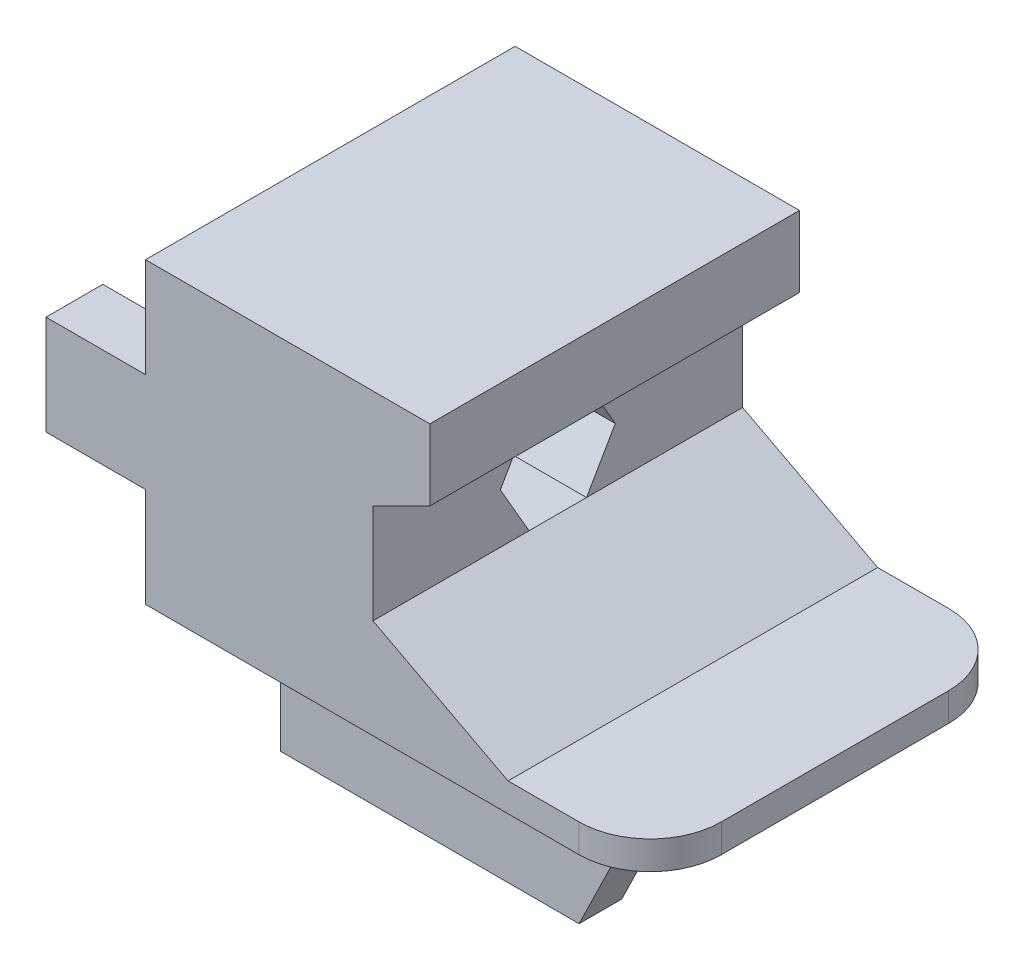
ISO-10303-21;
HEADER;
FILE_DESCRIPTION(('STEP AP214'),'2;1');
FILE_NAME('part.step','',(''),(''),'','','');
FILE_SCHEMA(('AUTOMOTIVE_DESIGN { 1 0 10303 214 1 1 1 1 }'));
ENDSEC;
DATA;
#1=APPLICATION_CONTEXT('core data for automotive mechanical design processes');
#2=APPLICATION_PROTOCOL_DEFINITION('international standard','automotive_design',2000,#1);
#3=PRODUCT_CONTEXT('',#1,'mechanical');
#4=PRODUCT('Part','Part','',(#3));
#5=PRODUCT_RELATED_PRODUCT_CATEGORY('part','',(#4));
#6=PRODUCT_DEFINITION_FORMATION('','',#4);
#7=PRODUCT_DEFINITION_CONTEXT('part definition',#1,'design');
#8=PRODUCT_DEFINITION('design','',#6,#7);
#9=PRODUCT_DEFINITION_SHAPE('','',#8);
#10=(LENGTH_UNIT() NAMED_UNIT(*) SI_UNIT(.MILLI.,.METRE.));
#11=(NAMED_UNIT(*) PLANE_ANGLE_UNIT() SI_UNIT($,.RADIAN.));
#12=(NAMED_UNIT(*) SI_UNIT($,.STERADIAN.) SOLID_ANGLE_UNIT());
#13=UNCERTAINTY_MEASURE_WITH_UNIT(LENGTH_MEASURE(1.E-05),#10,'distance_accuracy_value','');
#14=(GEOMETRIC_REPRESENTATION_CONTEXT(3) GLOBAL_UNCERTAINTY_ASSIGNED_CONTEXT((#13)) GLOBAL_UNIT_ASSIGNED_CONTEXT((#10,
#11,#12)) REPRESENTATION_CONTEXT('',''));
#15=CARTESIAN_POINT('',(0.,0.,0.));
#16=DIRECTION('',(0.,0.,1.));
#17=DIRECTION('',(1.,0.,0.));
#18=AXIS2_PLACEMENT_3D('',#15,#16,#17);
#19=CARTESIAN_POINT('',(16.,14.,26.));
#20=DIRECTION('',(-1.,0.,0.));
#21=DIRECTION('',(0.,0.,1.));
#22=AXIS2_PLACEMENT_3D('',#19,#20,#21);
#23=PLANE('',#22);
#24=DIRECTION('',(0.,0.,-1.));
#25=VECTOR('',#24,1.);
#26=CARTESIAN_POINT('',(16.,7.,26.));
#27=LINE('',#26,#25);
#28=CARTESIAN_POINT('',(16.,7.,26.));
#29=VERTEX_POINT('',#28);
#30=CARTESIAN_POINT('',(16.,7.,15.0207259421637));
#31=VERTEX_POINT('',#30);
#32=EDGE_CURVE('E477',#29,#31,#27,.T.);
#33=ORIENTED_EDGE('',*,*,#32,.T.);
#34=DIRECTION('',(0.,-0.866025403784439,-0.5));
#35=VECTOR('',#34,1.);
#36=CARTESIAN_POINT('',(16.,10.5,17.0414518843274));
#37=LINE('',#36,#35);
#38=CARTESIAN_POINT('',(16.,10.5,17.0414518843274));
#39=VERTEX_POINT('',#38);
#40=EDGE_CURVE('E280',#39,#31,#37,.T.);
#41=ORIENTED_EDGE('',*,*,#40,.F.);
#42=DIRECTION('',(0.,-0.866025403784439,0.5));
#43=VECTOR('',#42,1.);
#44=CARTESIAN_POINT('',(16.,14.,15.0207259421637));
#45=LINE('',#44,#43);
#46=CARTESIAN_POINT('',(16.,14.,15.0207259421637));
#47=VERTEX_POINT('',#46);
#48=EDGE_CURVE('E296',#47,#39,#45,.T.);
#49=ORIENTED_EDGE('',*,*,#48,.F.);
#50=DIRECTION('',(0.,0.,-1.));
#51=VECTOR('',#50,1.);
#52=CARTESIAN_POINT('',(16.,14.,26.));
#53=LINE('',#52,#51);
#54=CARTESIAN_POINT('',(16.,14.,26.));
#55=VERTEX_POINT('',#54);
#56=EDGE_CURVE('E473',#55,#47,#53,.T.);
#57=ORIENTED_EDGE('',*,*,#56,.F.);
#58=DIRECTION('',(0.,1.,0.));
#59=VECTOR('',#58,1.);
#60=CARTESIAN_POINT('',(16.,14.,26.));
#61=LINE('',#60,#59);
#62=EDGE_CURVE('E437',#29,#55,#61,.T.);
#63=ORIENTED_EDGE('',*,*,#62,.F.);
#64=EDGE_LOOP('',(#33,#41,#49,#57,#63));
#65=FACE_BOUND('',#64,.T.);
#66=ADVANCED_FACE('F32',(#65),#23,.F.);
#67=CARTESIAN_POINT('',(-7.,10.5,13.));
#68=DIRECTION('',(1.,0.,0.));
#69=DIRECTION('',(0.,0.,-1.));
#70=AXIS2_PLACEMENT_3D('',#67,#68,#69);
#71=CYLINDRICAL_SURFACE('',#70,2.);
#72=CARTESIAN_POINT('',(-2.,10.5,13.));
#73=DIRECTION('',(-1.,0.,0.));
#74=DIRECTION('',(0.,0.,1.));
#75=AXIS2_PLACEMENT_3D('',#72,#73,#74);
#76=CIRCLE('',#75,2.);
#77=CARTESIAN_POINT('',(-2.,10.5,15.));
#78=VERTEX_POINT('',#77);
#79=EDGE_CURVE('E315',#78,#78,#76,.T.);
#80=ORIENTED_EDGE('',*,*,#79,.T.);
#81=EDGE_LOOP('',(#80));
#82=FACE_BOUND('',#81,.T.);
#83=CARTESIAN_POINT('',(9.,10.5,13.));
#84=DIRECTION('',(1.,0.,0.));
#85=DIRECTION('',(0.,0.,-1.));
#86=AXIS2_PLACEMENT_3D('',#83,#84,#85);
#87=CIRCLE('',#86,2.);
#88=CARTESIAN_POINT('',(9.,10.5,11.));
#89=VERTEX_POINT('',#88);
#90=EDGE_CURVE('E303',#89,#89,#87,.F.);
#91=ORIENTED_EDGE('',*,*,#90,.F.);
#92=EDGE_LOOP('',(#91));
#93=FACE_BOUND('',#92,.T.);
#94=ADVANCED_FACE('F547',(#82,#93),#71,.F.);
#95=CARTESIAN_POINT('',(-7.,0.,0.));
#96=DIRECTION('',(-1.,0.,0.));
#97=DIRECTION('',(0.,0.,1.));
#98=AXIS2_PLACEMENT_3D('',#95,#96,#97);
#99=PLANE('',#98);
#100=DIRECTION('',(0.,-1.,0.));
#101=VECTOR('',#100,1.);
#102=CARTESIAN_POINT('',(-7.,0.,4.));
#103=LINE('',#102,#101);
#104=CARTESIAN_POINT('',(-7.,14.,4.));
#105=VERTEX_POINT('',#104);
#106=CARTESIAN_POINT('',(-7.,7.,4.));
#107=VERTEX_POINT('',#106);
#108=EDGE_CURVE('E496',#105,#107,#103,.T.);
#109=ORIENTED_EDGE('',*,*,#108,.F.);
#110=DIRECTION('',(0.,0.,-1.));
#111=VECTOR('',#110,1.);
#112=CARTESIAN_POINT('',(-7.,14.,0.));
#113=LINE('',#112,#111);
#114=CARTESIAN_POINT('',(-7.,14.,0.));
#115=VERTEX_POINT('',#114);
#116=EDGE_CURVE('E336',#105,#115,#113,.T.);
#117=ORIENTED_EDGE('',*,*,#116,.T.);
#118=DIRECTION('',(0.,-1.,0.));
#119=VECTOR('',#118,1.);
#120=CARTESIAN_POINT('',(-7.,14.,0.));
#121=LINE('',#120,#119);
#122=CARTESIAN_POINT('',(-7.,7.,0.));
#123=VERTEX_POINT('',#122);
#124=EDGE_CURVE('E341',#115,#123,#121,.T.);
#125=ORIENTED_EDGE('',*,*,#124,.T.);
#126=DIRECTION('',(0.,0.,1.));
#127=VECTOR('',#126,1.);
#128=CARTESIAN_POINT('',(-7.,7.,0.));
#129=LINE('',#128,#127);
#130=EDGE_CURVE('E344',#123,#107,#129,.T.);
#131=ORIENTED_EDGE('',*,*,#130,.T.);
#132=EDGE_LOOP('',(#109,#117,#125,#131));
#133=FACE_BOUND('',#132,.T.);
#134=ADVANCED_FACE('F554',(#133),#99,.T.);
#135=CARTESIAN_POINT('',(0.,0.,26.));
#136=DIRECTION('',(1.,0.,0.));
#137=DIRECTION('',(0.,0.,-1.));
#138=AXIS2_PLACEMENT_3D('',#135,#136,#137);
#139=PLANE('',#138);
#140=DIRECTION('',(0.,0.,1.));
#141=VECTOR('',#140,1.);
#142=CARTESIAN_POINT('',(0.,7.,0.));
#143=LINE('',#142,#141);
#144=CARTESIAN_POINT('',(0.,7.,0.));
#145=VERTEX_POINT('',#144);
#146=CARTESIAN_POINT('',(0.,7.,26.));
#147=VERTEX_POINT('',#146);
#148=EDGE_CURVE('E337',#145,#147,#143,.T.);
#149=ORIENTED_EDGE('',*,*,#148,.F.);
#150=DIRECTION('',(0.,-1.,0.));
#151=VECTOR('',#150,1.);
#152=CARTESIAN_POINT('',(0.,0.,0.));
#153=LINE('',#152,#151);
#154=CARTESIAN_POINT('',(0.,0.,0.));
#155=VERTEX_POINT('',#154);
#156=EDGE_CURVE('E426',#145,#155,#153,.T.);
#157=ORIENTED_EDGE('',*,*,#156,.T.);
#158=DIRECTION('',(0.,0.,-1.));
#159=VECTOR('',#158,1.);
#160=CARTESIAN_POINT('',(0.,0.,26.));
#161=LINE('',#160,#159);
#162=CARTESIAN_POINT('',(0.,0.,26.));
#163=VERTEX_POINT('',#162);
#164=EDGE_CURVE('E489',#163,#155,#161,.T.);
#165=ORIENTED_EDGE('',*,*,#164,.F.);
#166=DIRECTION('',(0.,-1.,0.));
#167=VECTOR('',#166,1.);
#168=CARTESIAN_POINT('',(0.,0.,26.));
#169=LINE('',#168,#167);
#170=EDGE_CURVE('E431',#147,#163,#169,.T.);
#171=ORIENTED_EDGE('',*,*,#170,.F.);
#172=EDGE_LOOP('',(#149,#157,#165,#171));
#173=FACE_BOUND('',#172,.T.);
#174=ADVANCED_FACE('F616',(#173),#139,.F.);
#175=DIRECTION('',(0.,0.,-1.));
#176=VECTOR('',#175,1.);
#177=CARTESIAN_POINT('',(0.,14.,0.));
#178=LINE('',#177,#176);
#179=CARTESIAN_POINT('',(0.,14.,26.));
#180=VERTEX_POINT('',#179);
#181=CARTESIAN_POINT('',(0.,14.,0.));
#182=VERTEX_POINT('',#181);
#183=EDGE_CURVE('E332',#180,#182,#178,.T.);
#184=ORIENTED_EDGE('',*,*,#183,.F.);
#185=CARTESIAN_POINT('',(0.,21.,26.));
#186=VERTEX_POINT('',#185);
#187=EDGE_CURVE('E427',#186,#180,#169,.T.);
#188=ORIENTED_EDGE('',*,*,#187,.F.);
#189=DIRECTION('',(0.,0.,-1.));
#190=VECTOR('',#189,1.);
#191=CARTESIAN_POINT('',(0.,21.,26.));
#192=LINE('',#191,#190);
#193=CARTESIAN_POINT('',(0.,21.,0.));
#194=VERTEX_POINT('',#193);
#195=EDGE_CURVE('E445',#186,#194,#192,.T.);
#196=ORIENTED_EDGE('',*,*,#195,.T.);
#197=EDGE_CURVE('E446',#194,#182,#153,.T.);
#198=ORIENTED_EDGE('',*,*,#197,.T.);
#199=EDGE_LOOP('',(#184,#188,#196,#198));
#200=FACE_BOUND('',#199,.T.);
#201=ADVANCED_FACE('F622',(#200),#139,.F.);
#202=CARTESIAN_POINT('',(0.,0.,26.));
#203=DIRECTION('',(0.,1.,0.));
#204=DIRECTION('',(0.,0.,1.));
#205=AXIS2_PLACEMENT_3D('',#202,#203,#204);
#206=PLANE('',#205);
#207=DIRECTION('',(0.,0.,1.));
#208=VECTOR('',#207,1.);
#209=CARTESIAN_POINT('',(30.5,0.,22.));
#210=LINE('',#209,#208);
#211=CARTESIAN_POINT('',(30.5,0.,19.));
#212=VERTEX_POINT('',#211);
#213=CARTESIAN_POINT('',(30.5,0.,22.));
#214=VERTEX_POINT('',#213);
#215=EDGE_CURVE('E417',#212,#214,#210,.T.);
#216=ORIENTED_EDGE('',*,*,#215,.F.);
#217=DIRECTION('',(1.,0.,0.));
#218=VECTOR('',#217,1.);
#219=CARTESIAN_POINT('',(5.49999999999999,0.,19.));
#220=LINE('',#219,#218);
#221=CARTESIAN_POINT('',(5.49999999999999,0.,19.));
#222=VERTEX_POINT('',#221);
#223=EDGE_CURVE('E414',#222,#212,#220,.T.);
#224=ORIENTED_EDGE('',*,*,#223,.F.);
#225=DIRECTION('',(0.,0.,-1.));
#226=VECTOR('',#225,1.);
#227=CARTESIAN_POINT('',(5.49999999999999,0.,22.));
#228=LINE('',#227,#226);
#229=CARTESIAN_POINT('',(5.49999999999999,0.,22.));
#230=VERTEX_POINT('',#229);
#231=EDGE_CURVE('E401',#230,#222,#228,.T.);
#232=ORIENTED_EDGE('',*,*,#231,.F.);
#233=DIRECTION('',(-1.,0.,0.));
#234=VECTOR('',#233,1.);
#235=CARTESIAN_POINT('',(5.49999999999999,0.,22.));
#236=LINE('',#235,#234);
#237=EDGE_CURVE('E406',#214,#230,#236,.T.);
#238=ORIENTED_EDGE('',*,*,#237,.F.);
#239=EDGE_LOOP('',(#216,#224,#232,#238));
#240=FACE_BOUND('',#239,.T.);
#241=DIRECTION('',(1.,0.,0.));
#242=VECTOR('',#241,1.);
#243=CARTESIAN_POINT('',(0.,0.,0.));
#244=LINE('',#243,#242);
#245=CARTESIAN_POINT('',(30.5,0.,0.));
#246=VERTEX_POINT('',#245);
#247=EDGE_CURVE('E448',#155,#246,#244,.T.);
#248=ORIENTED_EDGE('',*,*,#247,.T.);
#249=CARTESIAN_POINT('',(30.5,0.,5.));
#250=DIRECTION('',(0.,1.,0.));
#251=DIRECTION('',(0.,0.,1.));
#252=AXIS2_PLACEMENT_3D('',#249,#250,#251);
#253=CIRCLE('',#252,5.);
#254=CARTESIAN_POINT('',(35.5,0.,5.00000000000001));
#255=VERTEX_POINT('',#254);
#256=EDGE_CURVE('E40',#246,#255,#253,.F.);
#257=ORIENTED_EDGE('',*,*,#256,.T.);
#258=DIRECTION('',(0.,0.,-1.));
#259=VECTOR('',#258,1.);
#260=CARTESIAN_POINT('',(35.5,0.,26.));
#261=LINE('',#260,#259);
#262=CARTESIAN_POINT('',(35.5,0.,21.));
#263=VERTEX_POINT('',#262);
#264=EDGE_CURVE('E486',#263,#255,#261,.T.);
#265=ORIENTED_EDGE('',*,*,#264,.F.);
#266=CARTESIAN_POINT('',(30.5,0.,21.));
#267=DIRECTION('',(0.,1.,0.));
#268=DIRECTION('',(0.,0.,1.));
#269=AXIS2_PLACEMENT_3D('',#266,#267,#268);
#270=CIRCLE('',#269,5.);
#271=CARTESIAN_POINT('',(30.5,0.,26.));
#272=VERTEX_POINT('',#271);
#273=EDGE_CURVE('E47',#263,#272,#270,.F.);
#274=ORIENTED_EDGE('',*,*,#273,.T.);
#275=DIRECTION('',(1.,0.,0.));
#276=VECTOR('',#275,1.);
#277=CARTESIAN_POINT('',(0.,0.,26.));
#278=LINE('',#277,#276);
#279=EDGE_CURVE('E430',#163,#272,#278,.T.);
#280=ORIENTED_EDGE('',*,*,#279,.F.);
#281=ORIENTED_EDGE('',*,*,#164,.T.);
#282=EDGE_LOOP('',(#248,#257,#265,#274,#280,#281));
#283=FACE_BOUND('',#282,.T.);
#284=DIRECTION('',(0.,0.,-1.));
#285=VECTOR('',#284,1.);
#286=CARTESIAN_POINT('',(5.49999999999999,0.,7.));
#287=LINE('',#286,#285);
#288=CARTESIAN_POINT('',(5.49999999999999,0.,7.));
#289=VERTEX_POINT('',#288);
#290=CARTESIAN_POINT('',(5.49999999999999,0.,4.));
#291=VERTEX_POINT('',#290);
#292=EDGE_CURVE('E376',#289,#291,#287,.T.);
#293=ORIENTED_EDGE('',*,*,#292,.F.);
#294=DIRECTION('',(-1.,0.,0.));
#295=VECTOR('',#294,1.);
#296=CARTESIAN_POINT('',(5.49999999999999,0.,7.));
#297=LINE('',#296,#295);
#298=CARTESIAN_POINT('',(30.5,0.,7.));
#299=VERTEX_POINT('',#298);
#300=EDGE_CURVE('E381',#299,#289,#297,.T.);
#301=ORIENTED_EDGE('',*,*,#300,.F.);
#302=DIRECTION('',(0.,0.,1.));
#303=VECTOR('',#302,1.);
#304=CARTESIAN_POINT('',(30.5,0.,7.));
#305=LINE('',#304,#303);
#306=CARTESIAN_POINT('',(30.5,0.,4.));
#307=VERTEX_POINT('',#306);
#308=EDGE_CURVE('E392',#307,#299,#305,.T.);
#309=ORIENTED_EDGE('',*,*,#308,.F.);
#310=DIRECTION('',(1.,0.,0.));
#311=VECTOR('',#310,1.);
#312=CARTESIAN_POINT('',(5.49999999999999,0.,4.));
#313=LINE('',#312,#311);
#314=EDGE_CURVE('E389',#291,#307,#313,.T.);
#315=ORIENTED_EDGE('',*,*,#314,.F.);
#316=EDGE_LOOP('',(#293,#301,#309,#315));
#317=FACE_BOUND('',#316,.T.);
#318=ADVANCED_FACE('F515',(#240,#283,#317),#206,.F.);
#319=CARTESIAN_POINT('',(35.5,0.,26.));
#320=DIRECTION('',(-1.,0.,0.));
#321=DIRECTION('',(0.,0.,1.));
#322=AXIS2_PLACEMENT_3D('',#319,#320,#321);
#323=PLANE('',#322);
#324=ORIENTED_EDGE('',*,*,#264,.T.);
#325=DIRECTION('',(0.,1.,0.));
#326=VECTOR('',#325,1.);
#327=CARTESIAN_POINT('',(35.5,2.,5.));
#328=LINE('',#327,#326);
#329=CARTESIAN_POINT('',(35.5,2.,5.00000000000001));
#330=VERTEX_POINT('',#329);
#331=EDGE_CURVE('E506',#255,#330,#328,.T.);
#332=ORIENTED_EDGE('',*,*,#331,.T.);
#333=DIRECTION('',(0.,0.,-1.));
#334=VECTOR('',#333,1.);
#335=CARTESIAN_POINT('',(35.5,2.,26.));
#336=LINE('',#335,#334);
#337=CARTESIAN_POINT('',(35.5,2.,21.));
#338=VERTEX_POINT('',#337);
#339=EDGE_CURVE('E483',#338,#330,#336,.T.);
#340=ORIENTED_EDGE('',*,*,#339,.F.);
#341=DIRECTION('',(0.,1.,0.));
#342=VECTOR('',#341,1.);
#343=CARTESIAN_POINT('',(35.5,0.,21.));
#344=LINE('',#343,#342);
#345=EDGE_CURVE('E500',#338,#263,#344,.F.);
#346=ORIENTED_EDGE('',*,*,#345,.T.);
#347=EDGE_LOOP('',(#324,#332,#340,#346));
#348=FACE_BOUND('',#347,.T.);
#349=ADVANCED_FACE('F520',(#348),#323,.F.);
#350=CARTESIAN_POINT('',(25.5,2.,26.));
#351=DIRECTION('',(0.,-1.,0.));
#352=DIRECTION('',(0.,0.,-1.));
#353=AXIS2_PLACEMENT_3D('',#350,#351,#352);
#354=PLANE('',#353);
#355=ORIENTED_EDGE('',*,*,#339,.T.);
#356=CARTESIAN_POINT('',(30.5,2.,5.));
#357=DIRECTION('',(0.,-1.,0.));
#358=DIRECTION('',(0.,0.,-1.));
#359=AXIS2_PLACEMENT_3D('',#356,#357,#358);
#360=CIRCLE('',#359,5.);
#361=CARTESIAN_POINT('',(30.5,2.,0.));
#362=VERTEX_POINT('',#361);
#363=EDGE_CURVE('E511',#330,#362,#360,.F.);
#364=ORIENTED_EDGE('',*,*,#363,.T.);
#365=DIRECTION('',(-1.,0.,0.));
#366=VECTOR('',#365,1.);
#367=CARTESIAN_POINT('',(25.5,2.,0.));
#368=LINE('',#367,#366);
#369=CARTESIAN_POINT('',(25.5,2.,0.));
#370=VERTEX_POINT('',#369);
#371=EDGE_CURVE('E450',#362,#370,#368,.T.);
#372=ORIENTED_EDGE('',*,*,#371,.T.);
#373=DIRECTION('',(0.,0.,-1.));
#374=VECTOR('',#373,1.);
#375=CARTESIAN_POINT('',(25.5,2.,26.));
#376=LINE('',#375,#374);
#377=CARTESIAN_POINT('',(25.5,2.,26.));
#378=VERTEX_POINT('',#377);
#379=EDGE_CURVE('E480',#378,#370,#376,.T.);
#380=ORIENTED_EDGE('',*,*,#379,.F.);
#381=DIRECTION('',(-1.,0.,0.));
#382=VECTOR('',#381,1.);
#383=CARTESIAN_POINT('',(25.5,2.,26.));
#384=LINE('',#383,#382);
#385=CARTESIAN_POINT('',(30.5,2.,26.));
#386=VERTEX_POINT('',#385);
#387=EDGE_CURVE('E433',#386,#378,#384,.T.);
#388=ORIENTED_EDGE('',*,*,#387,.F.);
#389=CARTESIAN_POINT('',(30.5,2.,21.));
#390=DIRECTION('',(0.,-1.,0.));
#391=DIRECTION('',(0.,0.,-1.));
#392=AXIS2_PLACEMENT_3D('',#389,#390,#391);
#393=CIRCLE('',#392,5.);
#394=EDGE_CURVE('E509',#386,#338,#393,.F.);
#395=ORIENTED_EDGE('',*,*,#394,.T.);
#396=EDGE_LOOP('',(#355,#364,#372,#380,#388,#395));
#397=FACE_BOUND('',#396,.T.);
#398=ADVANCED_FACE('F525',(#397),#354,.F.);
#399=CARTESIAN_POINT('',(16.,7.,26.));
#400=DIRECTION('',(-0.465746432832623,-0.884918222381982,0.));
#401=DIRECTION('',(0.884918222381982,-0.465746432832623,0.));
#402=AXIS2_PLACEMENT_3D('',#399,#400,#401);
#403=PLANE('',#402);
#404=DIRECTION('',(-0.884918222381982,0.465746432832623,0.));
#405=VECTOR('',#404,1.);
#406=CARTESIAN_POINT('',(16.,7.,0.));
#407=LINE('',#406,#405);
#408=CARTESIAN_POINT('',(16.,7.,0.));
#409=VERTEX_POINT('',#408);
#410=EDGE_CURVE('E452',#370,#409,#407,.T.);
#411=ORIENTED_EDGE('',*,*,#410,.T.);
#412=CARTESIAN_POINT('',(16.,7.,10.9792740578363));
#413=VERTEX_POINT('',#412);
#414=EDGE_CURVE('E476',#413,#409,#27,.T.);
#415=ORIENTED_EDGE('',*,*,#414,.F.);
#416=DIRECTION('',(0.,0.,-1.));
#417=VECTOR('',#416,1.);
#418=CARTESIAN_POINT('',(16.,7.,15.0207259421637));
#419=LINE('',#418,#417);
#420=EDGE_CURVE('E277',#31,#413,#419,.T.);
#421=ORIENTED_EDGE('',*,*,#420,.F.);
#422=ORIENTED_EDGE('',*,*,#32,.F.);
#423=DIRECTION('',(-0.884918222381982,0.465746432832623,0.));
#424=VECTOR('',#423,1.);
#425=CARTESIAN_POINT('',(16.,7.,26.));
#426=LINE('',#425,#424);
#427=EDGE_CURVE('E435',#378,#29,#426,.T.);
#428=ORIENTED_EDGE('',*,*,#427,.F.);
#429=ORIENTED_EDGE('',*,*,#379,.T.);
#430=EDGE_LOOP('',(#411,#415,#421,#422,#428,#429));
#431=FACE_BOUND('',#430,.T.);
#432=ADVANCED_FACE('F533',(#431),#403,.F.);
#433=DIRECTION('',(0.,0.866025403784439,0.5));
#434=VECTOR('',#433,1.);
#435=CARTESIAN_POINT('',(16.,10.5,8.95854811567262));
#436=LINE('',#435,#434);
#437=CARTESIAN_POINT('',(16.,10.5,8.95854811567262));
#438=VERTEX_POINT('',#437);
#439=CARTESIAN_POINT('',(16.,14.,10.9792740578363));
#440=VERTEX_POINT('',#439);
#441=EDGE_CURVE('E291',#438,#440,#436,.T.);
#442=ORIENTED_EDGE('',*,*,#441,.F.);
#443=DIRECTION('',(0.,0.866025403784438,-0.5));
#444=VECTOR('',#443,1.);
#445=CARTESIAN_POINT('',(16.,7.,10.9792740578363));
#446=LINE('',#445,#444);
#447=EDGE_CURVE('E258',#413,#438,#446,.T.);
#448=ORIENTED_EDGE('',*,*,#447,.F.);
#449=ORIENTED_EDGE('',*,*,#414,.T.);
#450=DIRECTION('',(0.,1.,0.));
#451=VECTOR('',#450,1.);
#452=CARTESIAN_POINT('',(16.,14.,0.));
#453=LINE('',#452,#451);
#454=CARTESIAN_POINT('',(16.,14.,0.));
#455=VERTEX_POINT('',#454);
#456=EDGE_CURVE('E455',#409,#455,#453,.T.);
#457=ORIENTED_EDGE('',*,*,#456,.T.);
#458=EDGE_CURVE('E472',#440,#455,#53,.T.);
#459=ORIENTED_EDGE('',*,*,#458,.F.);
#460=EDGE_LOOP('',(#442,#448,#449,#457,#459));
#461=FACE_BOUND('',#460,.T.);
#462=ADVANCED_FACE('F550',(#461),#23,.F.);
#463=CARTESIAN_POINT('',(16.,14.,26.));
#464=DIRECTION('',(-0.447213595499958,0.894427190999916,0.));
#465=DIRECTION('',(-0.894427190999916,-0.447213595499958,0.));
#466=AXIS2_PLACEMENT_3D('',#463,#464,#465);
#467=PLANE('',#466);
#468=DIRECTION('',(0.894427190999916,0.447213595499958,0.));
#469=VECTOR('',#468,1.);
#470=CARTESIAN_POINT('',(16.,14.,0.));
#471=LINE('',#470,#469);
#472=CARTESIAN_POINT('',(20.,16.,0.));
#473=VERTEX_POINT('',#472);
#474=EDGE_CURVE('E458',#455,#473,#471,.T.);
#475=ORIENTED_EDGE('',*,*,#474,.T.);
#476=DIRECTION('',(0.,0.,-1.));
#477=VECTOR('',#476,1.);
#478=CARTESIAN_POINT('',(20.,16.,26.));
#479=LINE('',#478,#477);
#480=CARTESIAN_POINT('',(20.,16.,26.));
#481=VERTEX_POINT('',#480);
#482=EDGE_CURVE('E469',#481,#473,#479,.T.);
#483=ORIENTED_EDGE('',*,*,#482,.F.);
#484=DIRECTION('',(0.894427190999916,0.447213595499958,0.));
#485=VECTOR('',#484,1.);
#486=CARTESIAN_POINT('',(16.,14.,26.));
#487=LINE('',#486,#485);
#488=EDGE_CURVE('E439',#55,#481,#487,.T.);
#489=ORIENTED_EDGE('',*,*,#488,.F.);
#490=ORIENTED_EDGE('',*,*,#56,.T.);
#491=DIRECTION('',(0.,0.,1.));
#492=VECTOR('',#491,1.);
#493=CARTESIAN_POINT('',(16.,14.,10.9792740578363));
#494=LINE('',#493,#492);
#495=EDGE_CURVE('E293',#440,#47,#494,.T.);
#496=ORIENTED_EDGE('',*,*,#495,.F.);
#497=ORIENTED_EDGE('',*,*,#458,.T.);
#498=EDGE_LOOP('',(#475,#483,#489,#490,#496,#497));
#499=FACE_BOUND('',#498,.T.);
#500=ADVANCED_FACE('F560',(#499),#467,.F.);
#501=CARTESIAN_POINT('',(20.,16.,26.));
#502=DIRECTION('',(-1.,0.,0.));
#503=DIRECTION('',(0.,0.,1.));
#504=AXIS2_PLACEMENT_3D('',#501,#502,#503);
#505=PLANE('',#504);
#506=DIRECTION('',(0.,1.,0.));
#507=VECTOR('',#506,1.);
#508=CARTESIAN_POINT('',(20.,16.,0.));
#509=LINE('',#508,#507);
#510=CARTESIAN_POINT('',(20.,21.,0.));
#511=VERTEX_POINT('',#510);
#512=EDGE_CURVE('E460',#473,#511,#509,.T.);
#513=ORIENTED_EDGE('',*,*,#512,.T.);
#514=DIRECTION('',(0.,0.,-1.));
#515=VECTOR('',#514,1.);
#516=CARTESIAN_POINT('',(20.,21.,26.));
#517=LINE('',#516,#515);
#518=CARTESIAN_POINT('',(20.,21.,26.));
#519=VERTEX_POINT('',#518);
#520=EDGE_CURVE('E466',#519,#511,#517,.T.);
#521=ORIENTED_EDGE('',*,*,#520,.F.);
#522=DIRECTION('',(0.,1.,0.));
#523=VECTOR('',#522,1.);
#524=CARTESIAN_POINT('',(20.,16.,26.));
#525=LINE('',#524,#523);
#526=EDGE_CURVE('E441',#481,#519,#525,.T.);
#527=ORIENTED_EDGE('',*,*,#526,.F.);
#528=ORIENTED_EDGE('',*,*,#482,.T.);
#529=EDGE_LOOP('',(#513,#521,#527,#528));
#530=FACE_BOUND('',#529,.T.);
#531=ADVANCED_FACE('F566',(#530),#505,.F.);
#532=CARTESIAN_POINT('',(0.,21.,26.));
#533=DIRECTION('',(0.,-1.,0.));
#534=DIRECTION('',(0.,0.,-1.));
#535=AXIS2_PLACEMENT_3D('',#532,#533,#534);
#536=PLANE('',#535);
#537=DIRECTION('',(-1.,0.,0.));
#538=VECTOR('',#537,1.);
#539=CARTESIAN_POINT('',(0.,21.,0.));
#540=LINE('',#539,#538);
#541=EDGE_CURVE('E462',#511,#194,#540,.T.);
#542=ORIENTED_EDGE('',*,*,#541,.T.);
#543=ORIENTED_EDGE('',*,*,#195,.F.);
#544=DIRECTION('',(-1.,0.,0.));
#545=VECTOR('',#544,1.);
#546=CARTESIAN_POINT('',(0.,21.,26.));
#547=LINE('',#546,#545);
#548=EDGE_CURVE('E443',#519,#186,#547,.T.);
#549=ORIENTED_EDGE('',*,*,#548,.F.);
#550=ORIENTED_EDGE('',*,*,#520,.T.);
#551=EDGE_LOOP('',(#542,#543,#549,#550));
#552=FACE_BOUND('',#551,.T.);
#553=ADVANCED_FACE('F594',(#552),#536,.F.);
#554=CARTESIAN_POINT('',(0.,0.,26.));
#555=DIRECTION('',(0.,0.,-1.));
#556=DIRECTION('',(-1.,0.,0.));
#557=AXIS2_PLACEMENT_3D('',#554,#555,#556);
#558=PLANE('',#557);
#559=ORIENTED_EDGE('',*,*,#279,.T.);
#560=DIRECTION('',(0.,1.,0.));
#561=VECTOR('',#560,1.);
#562=CARTESIAN_POINT('',(30.5,0.,26.));
#563=LINE('',#562,#561);
#564=EDGE_CURVE('E11',#272,#386,#563,.T.);
#565=ORIENTED_EDGE('',*,*,#564,.T.);
#566=ORIENTED_EDGE('',*,*,#387,.T.);
#567=ORIENTED_EDGE('',*,*,#427,.T.);
#568=ORIENTED_EDGE('',*,*,#62,.T.);
#569=ORIENTED_EDGE('',*,*,#488,.T.);
#570=ORIENTED_EDGE('',*,*,#526,.T.);
#571=ORIENTED_EDGE('',*,*,#548,.T.);
#572=ORIENTED_EDGE('',*,*,#187,.T.);
#573=DIRECTION('',(1.,0.,0.));
#574=VECTOR('',#573,1.);
#575=CARTESIAN_POINT('',(-7.,14.,26.));
#576=LINE('',#575,#574);
#577=CARTESIAN_POINT('',(-7.,14.,26.));
#578=VERTEX_POINT('',#577);
#579=EDGE_CURVE('E360',#578,#180,#576,.T.);
#580=ORIENTED_EDGE('',*,*,#579,.F.);
#581=DIRECTION('',(0.,1.,0.));
#582=VECTOR('',#581,1.);
#583=CARTESIAN_POINT('',(-7.,14.,26.));
#584=LINE('',#583,#582);
#585=CARTESIAN_POINT('',(-7.,7.,26.));
#586=VERTEX_POINT('',#585);
#587=EDGE_CURVE('E333',#586,#578,#584,.T.);
#588=ORIENTED_EDGE('',*,*,#587,.F.);
#589=DIRECTION('',(1.,0.,0.));
#590=VECTOR('',#589,1.);
#591=CARTESIAN_POINT('',(-7.,7.,26.));
#592=LINE('',#591,#590);
#593=EDGE_CURVE('E347',#586,#147,#592,.T.);
#594=ORIENTED_EDGE('',*,*,#593,.T.);
#595=ORIENTED_EDGE('',*,*,#170,.T.);
#596=EDGE_LOOP('',(#559,#565,#566,#567,#568,#569,#570,#571,#572,#580,#588,#594,#595));
#597=FACE_BOUND('',#596,.T.);
#598=ADVANCED_FACE('F539',(#597),#558,.F.);
#599=CARTESIAN_POINT('',(0.,0.,0.));
#600=DIRECTION('',(0.,0.,-1.));
#601=DIRECTION('',(-1.,0.,0.));
#602=AXIS2_PLACEMENT_3D('',#599,#600,#601);
#603=PLANE('',#602);
#604=ORIENTED_EDGE('',*,*,#371,.F.);
#605=DIRECTION('',(0.,1.,0.));
#606=VECTOR('',#605,1.);
#607=CARTESIAN_POINT('',(30.5,0.,0.));
#608=LINE('',#607,#606);
#609=EDGE_CURVE('E55',#362,#246,#608,.F.);
#610=ORIENTED_EDGE('',*,*,#609,.T.);
#611=ORIENTED_EDGE('',*,*,#247,.F.);
#612=ORIENTED_EDGE('',*,*,#156,.F.);
#613=DIRECTION('',(1.,0.,0.));
#614=VECTOR('',#613,1.);
#615=CARTESIAN_POINT('',(-7.,7.,0.));
#616=LINE('',#615,#614);
#617=EDGE_CURVE('E354',#123,#145,#616,.T.);
#618=ORIENTED_EDGE('',*,*,#617,.F.);
#619=ORIENTED_EDGE('',*,*,#124,.F.);
#620=DIRECTION('',(1.,0.,0.));
#621=VECTOR('',#620,1.);
#622=CARTESIAN_POINT('',(-7.,14.,0.));
#623=LINE('',#622,#621);
#624=EDGE_CURVE('E357',#115,#182,#623,.T.);
#625=ORIENTED_EDGE('',*,*,#624,.T.);
#626=ORIENTED_EDGE('',*,*,#197,.F.);
#627=ORIENTED_EDGE('',*,*,#541,.F.);
#628=ORIENTED_EDGE('',*,*,#512,.F.);
#629=ORIENTED_EDGE('',*,*,#474,.F.);
#630=ORIENTED_EDGE('',*,*,#456,.F.);
#631=ORIENTED_EDGE('',*,*,#410,.F.);
#632=EDGE_LOOP('',(#604,#610,#611,#612,#618,#619,#625,#626,#627,#628,#629,#630,#631));
#633=FACE_BOUND('',#632,.T.);
#634=ADVANCED_FACE('F528',(#633),#603,.T.);
#635=CARTESIAN_POINT('',(5.49999999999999,-8.2,22.));
#636=DIRECTION('',(1.,0.,0.));
#637=DIRECTION('',(0.,0.,-1.));
#638=AXIS2_PLACEMENT_3D('',#635,#636,#637);
#639=PLANE('',#638);
#640=ORIENTED_EDGE('',*,*,#231,.T.);
#641=DIRECTION('',(0.,1.,0.));
#642=VECTOR('',#641,1.);
#643=CARTESIAN_POINT('',(5.49999999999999,-8.2,19.));
#644=LINE('',#643,#642);
#645=CARTESIAN_POINT('',(5.49999999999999,-8.2,19.));
#646=VERTEX_POINT('',#645);
#647=EDGE_CURVE('E423',#646,#222,#644,.T.);
#648=ORIENTED_EDGE('',*,*,#647,.F.);
#649=DIRECTION('',(0.,0.,-1.));
#650=VECTOR('',#649,1.);
#651=CARTESIAN_POINT('',(5.49999999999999,-8.2,22.));
#652=LINE('',#651,#650);
#653=CARTESIAN_POINT('',(5.49999999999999,-8.2,22.));
#654=VERTEX_POINT('',#653);
#655=EDGE_CURVE('E402',#654,#646,#652,.T.);
#656=ORIENTED_EDGE('',*,*,#655,.F.);
#657=DIRECTION('',(0.,1.,0.));
#658=VECTOR('',#657,1.);
#659=CARTESIAN_POINT('',(5.49999999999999,-8.2,22.));
#660=LINE('',#659,#658);
#661=EDGE_CURVE('E411',#654,#230,#660,.T.);
#662=ORIENTED_EDGE('',*,*,#661,.T.);
#663=EDGE_LOOP('',(#640,#648,#656,#662));
#664=FACE_BOUND('',#663,.T.);
#665=ADVANCED_FACE('F741',(#664),#639,.F.);
#666=CARTESIAN_POINT('',(5.49999999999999,-8.2,19.));
#667=DIRECTION('',(0.,0.,1.));
#668=DIRECTION('',(1.,0.,0.));
#669=AXIS2_PLACEMENT_3D('',#666,#667,#668);
#670=PLANE('',#669);
#671=ORIENTED_EDGE('',*,*,#223,.T.);
#672=DIRECTION('',(-0.438423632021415,-0.8987684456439,0.));
#673=VECTOR('',#672,1.);
#674=CARTESIAN_POINT('',(22.4634790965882,-16.4748678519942,19.));
#675=LINE('',#674,#673);
#676=CARTESIAN_POINT('',(26.5,-8.2,19.));
#677=VERTEX_POINT('',#676);
#678=EDGE_CURVE('E373',#212,#677,#675,.T.);
#679=ORIENTED_EDGE('',*,*,#678,.T.);
#680=DIRECTION('',(1.,0.,0.));
#681=VECTOR('',#680,1.);
#682=CARTESIAN_POINT('',(5.49999999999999,-8.2,19.));
#683=LINE('',#682,#681);
#684=EDGE_CURVE('E405',#646,#677,#683,.T.);
#685=ORIENTED_EDGE('',*,*,#684,.F.);
#686=ORIENTED_EDGE('',*,*,#647,.T.);
#687=EDGE_LOOP('',(#671,#679,#685,#686));
#688=FACE_BOUND('',#687,.T.);
#689=ADVANCED_FACE('F747',(#688),#670,.F.);
#690=CARTESIAN_POINT('',(5.49999999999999,-8.2,22.));
#691=DIRECTION('',(0.,0.,-1.));
#692=DIRECTION('',(-1.,0.,0.));
#693=AXIS2_PLACEMENT_3D('',#690,#691,#692);
#694=PLANE('',#693);
#695=DIRECTION('',(-1.,0.,0.));
#696=VECTOR('',#695,1.);
#697=CARTESIAN_POINT('',(5.49999999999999,-8.2,22.));
#698=LINE('',#697,#696);
#699=CARTESIAN_POINT('',(26.5,-8.2,22.));
#700=VERTEX_POINT('',#699);
#701=EDGE_CURVE('E409',#700,#654,#698,.T.);
#702=ORIENTED_EDGE('',*,*,#701,.F.);
#703=DIRECTION('',(0.438423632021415,0.8987684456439,0.));
#704=VECTOR('',#703,1.);
#705=CARTESIAN_POINT('',(22.4634790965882,-16.4748678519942,22.));
#706=LINE('',#705,#704);
#707=EDGE_CURVE('E370',#700,#214,#706,.T.);
#708=ORIENTED_EDGE('',*,*,#707,.T.);
#709=ORIENTED_EDGE('',*,*,#237,.T.);
#710=ORIENTED_EDGE('',*,*,#661,.F.);
#711=EDGE_LOOP('',(#702,#708,#709,#710));
#712=FACE_BOUND('',#711,.T.);
#713=ADVANCED_FACE('F758',(#712),#694,.F.);
#714=CARTESIAN_POINT('',(0.,-8.2,0.));
#715=DIRECTION('',(0.,-1.,0.));
#716=DIRECTION('',(0.,0.,-1.));
#717=AXIS2_PLACEMENT_3D('',#714,#715,#716);
#718=PLANE('',#717);
#719=DIRECTION('',(0.,0.,-1.));
#720=VECTOR('',#719,1.);
#721=CARTESIAN_POINT('',(26.5,-8.2,26.));
#722=LINE('',#721,#720);
#723=EDGE_CURVE('E365',#700,#677,#722,.T.);
#724=ORIENTED_EDGE('',*,*,#723,.F.);
#725=ORIENTED_EDGE('',*,*,#701,.T.);
#726=ORIENTED_EDGE('',*,*,#655,.T.);
#727=ORIENTED_EDGE('',*,*,#684,.T.);
#728=EDGE_LOOP('',(#724,#725,#726,#727));
#729=FACE_BOUND('',#728,.T.);
#730=ADVANCED_FACE('F767',(#729),#718,.T.);
#731=CARTESIAN_POINT('',(5.49999999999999,-8.2,7.));
#732=DIRECTION('',(1.,0.,0.));
#733=DIRECTION('',(0.,0.,-1.));
#734=AXIS2_PLACEMENT_3D('',#731,#732,#733);
#735=PLANE('',#734);
#736=ORIENTED_EDGE('',*,*,#292,.T.);
#737=DIRECTION('',(0.,1.,0.));
#738=VECTOR('',#737,1.);
#739=CARTESIAN_POINT('',(5.49999999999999,-8.2,4.));
#740=LINE('',#739,#738);
#741=CARTESIAN_POINT('',(5.49999999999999,-8.2,4.));
#742=VERTEX_POINT('',#741);
#743=EDGE_CURVE('E398',#742,#291,#740,.T.);
#744=ORIENTED_EDGE('',*,*,#743,.F.);
#745=DIRECTION('',(0.,0.,-1.));
#746=VECTOR('',#745,1.);
#747=CARTESIAN_POINT('',(5.49999999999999,-8.2,7.));
#748=LINE('',#747,#746);
#749=CARTESIAN_POINT('',(5.49999999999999,-8.2,7.));
#750=VERTEX_POINT('',#749);
#751=EDGE_CURVE('E377',#750,#742,#748,.T.);
#752=ORIENTED_EDGE('',*,*,#751,.F.);
#753=DIRECTION('',(0.,1.,0.));
#754=VECTOR('',#753,1.);
#755=CARTESIAN_POINT('',(5.49999999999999,-8.2,7.));
#756=LINE('',#755,#754);
#757=EDGE_CURVE('E386',#750,#289,#756,.T.);
#758=ORIENTED_EDGE('',*,*,#757,.T.);
#759=EDGE_LOOP('',(#736,#744,#752,#758));
#760=FACE_BOUND('',#759,.T.);
#761=ADVANCED_FACE('F776',(#760),#735,.F.);
#762=CARTESIAN_POINT('',(5.49999999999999,-8.2,4.));
#763=DIRECTION('',(0.,0.,1.));
#764=DIRECTION('',(1.,0.,0.));
#765=AXIS2_PLACEMENT_3D('',#762,#763,#764);
#766=PLANE('',#765);
#767=ORIENTED_EDGE('',*,*,#314,.T.);
#768=DIRECTION('',(0.438423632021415,0.8987684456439,0.));
#769=VECTOR('',#768,1.);
#770=CARTESIAN_POINT('',(30.5,0.,4.));
#771=LINE('',#770,#769);
#772=CARTESIAN_POINT('',(26.5,-8.2,4.));
#773=VERTEX_POINT('',#772);
#774=EDGE_CURVE('E363',#773,#307,#771,.T.);
#775=ORIENTED_EDGE('',*,*,#774,.F.);
#776=DIRECTION('',(1.,0.,0.));
#777=VECTOR('',#776,1.);
#778=CARTESIAN_POINT('',(5.49999999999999,-8.2,4.));
#779=LINE('',#778,#777);
#780=EDGE_CURVE('E380',#742,#773,#779,.T.);
#781=ORIENTED_EDGE('',*,*,#780,.F.);
#782=ORIENTED_EDGE('',*,*,#743,.T.);
#783=EDGE_LOOP('',(#767,#775,#781,#782));
#784=FACE_BOUND('',#783,.T.);
#785=ADVANCED_FACE('F785',(#784),#766,.F.);
#786=CARTESIAN_POINT('',(5.49999999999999,-8.2,7.));
#787=DIRECTION('',(0.,0.,-1.));
#788=DIRECTION('',(-1.,0.,0.));
#789=AXIS2_PLACEMENT_3D('',#786,#787,#788);
#790=PLANE('',#789);
#791=DIRECTION('',(-1.,0.,0.));
#792=VECTOR('',#791,1.);
#793=CARTESIAN_POINT('',(5.49999999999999,-8.2,7.));
#794=LINE('',#793,#792);
#795=CARTESIAN_POINT('',(26.5,-8.2,7.));
#796=VERTEX_POINT('',#795);
#797=EDGE_CURVE('E384',#796,#750,#794,.T.);
#798=ORIENTED_EDGE('',*,*,#797,.F.);
#799=DIRECTION('',(0.438423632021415,0.8987684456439,0.));
#800=VECTOR('',#799,1.);
#801=CARTESIAN_POINT('',(22.4634790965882,-16.4748678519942,7.));
#802=LINE('',#801,#800);
#803=EDGE_CURVE('E367',#796,#299,#802,.T.);
#804=ORIENTED_EDGE('',*,*,#803,.T.);
#805=ORIENTED_EDGE('',*,*,#300,.T.);
#806=ORIENTED_EDGE('',*,*,#757,.F.);
#807=EDGE_LOOP('',(#798,#804,#805,#806));
#808=FACE_BOUND('',#807,.T.);
#809=ADVANCED_FACE('F793',(#808),#790,.F.);
#810=CARTESIAN_POINT('',(0.,-8.2,0.));
#811=DIRECTION('',(0.,-1.,0.));
#812=DIRECTION('',(0.,0.,-1.));
#813=AXIS2_PLACEMENT_3D('',#810,#811,#812);
#814=PLANE('',#813);
#815=DIRECTION('',(0.,0.,-1.));
#816=VECTOR('',#815,1.);
#817=CARTESIAN_POINT('',(26.5,-8.2,0.));
#818=LINE('',#817,#816);
#819=EDGE_CURVE('E492',#796,#773,#818,.T.);
#820=ORIENTED_EDGE('',*,*,#819,.F.);
#821=ORIENTED_EDGE('',*,*,#797,.T.);
#822=ORIENTED_EDGE('',*,*,#751,.T.);
#823=ORIENTED_EDGE('',*,*,#780,.T.);
#824=EDGE_LOOP('',(#820,#821,#822,#823));
#825=FACE_BOUND('',#824,.T.);
#826=ADVANCED_FACE('F802',(#825),#814,.T.);
#827=CARTESIAN_POINT('',(30.5,0.,26.));
#828=DIRECTION('',(-0.8987684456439,0.438423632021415,0.));
#829=DIRECTION('',(-0.438423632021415,-0.8987684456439,0.));
#830=AXIS2_PLACEMENT_3D('',#827,#828,#829);
#831=PLANE('',#830);
#832=ORIENTED_EDGE('',*,*,#819,.T.);
#833=ORIENTED_EDGE('',*,*,#774,.T.);
#834=ORIENTED_EDGE('',*,*,#308,.T.);
#835=ORIENTED_EDGE('',*,*,#803,.F.);
#836=EDGE_LOOP('',(#832,#833,#834,#835));
#837=FACE_BOUND('',#836,.T.);
#838=ADVANCED_FACE('F811',(#837),#831,.F.);
#839=ORIENTED_EDGE('',*,*,#215,.T.);
#840=ORIENTED_EDGE('',*,*,#707,.F.);
#841=ORIENTED_EDGE('',*,*,#723,.T.);
#842=ORIENTED_EDGE('',*,*,#678,.F.);
#843=EDGE_LOOP('',(#839,#840,#841,#842));
#844=FACE_BOUND('',#843,.T.);
#845=ADVANCED_FACE('F820',(#844),#831,.F.);
#846=CARTESIAN_POINT('',(-7.,14.,0.));
#847=DIRECTION('',(0.,-1.,0.));
#848=DIRECTION('',(0.,0.,-1.));
#849=AXIS2_PLACEMENT_3D('',#846,#847,#848);
#850=PLANE('',#849);
#851=ORIENTED_EDGE('',*,*,#116,.F.);
#852=DIRECTION('',(1.,0.,0.));
#853=VECTOR('',#852,1.);
#854=CARTESIAN_POINT('',(-7.,14.,4.));
#855=LINE('',#854,#853);
#856=CARTESIAN_POINT('',(-2.,14.,4.));
#857=VERTEX_POINT('',#856);
#858=EDGE_CURVE('E327',#105,#857,#855,.T.);
#859=ORIENTED_EDGE('',*,*,#858,.T.);
#860=DIRECTION('',(0.,0.,-1.));
#861=VECTOR('',#860,1.);
#862=CARTESIAN_POINT('',(-2.,14.,0.));
#863=LINE('',#862,#861);
#864=CARTESIAN_POINT('',(-2.,14.,22.));
#865=VERTEX_POINT('',#864);
#866=EDGE_CURVE('E330',#865,#857,#863,.T.);
#867=ORIENTED_EDGE('',*,*,#866,.F.);
#868=DIRECTION('',(-1.,0.,0.));
#869=VECTOR('',#868,1.);
#870=CARTESIAN_POINT('',(-7.,14.,22.));
#871=LINE('',#870,#869);
#872=CARTESIAN_POINT('',(-7.,14.,22.));
#873=VERTEX_POINT('',#872);
#874=EDGE_CURVE('E321',#865,#873,#871,.T.);
#875=ORIENTED_EDGE('',*,*,#874,.T.);
#876=EDGE_CURVE('E338',#578,#873,#113,.T.);
#877=ORIENTED_EDGE('',*,*,#876,.F.);
#878=ORIENTED_EDGE('',*,*,#579,.T.);
#879=ORIENTED_EDGE('',*,*,#183,.T.);
#880=ORIENTED_EDGE('',*,*,#624,.F.);
#881=EDGE_LOOP('',(#851,#859,#867,#875,#877,#878,#879,#880));
#882=FACE_BOUND('',#881,.T.);
#883=ADVANCED_FACE('F601',(#882),#850,.F.);
#884=CARTESIAN_POINT('',(-7.,7.,0.));
#885=DIRECTION('',(0.,1.,0.));
#886=DIRECTION('',(0.,0.,1.));
#887=AXIS2_PLACEMENT_3D('',#884,#885,#886);
#888=PLANE('',#887);
#889=DIRECTION('',(0.,0.,1.));
#890=VECTOR('',#889,1.);
#891=CARTESIAN_POINT('',(-2.,7.,0.));
#892=LINE('',#891,#890);
#893=CARTESIAN_POINT('',(-2.,7.,4.));
#894=VERTEX_POINT('',#893);
#895=CARTESIAN_POINT('',(-2.,7.,22.));
#896=VERTEX_POINT('',#895);
#897=EDGE_CURVE('E498',#894,#896,#892,.T.);
#898=ORIENTED_EDGE('',*,*,#897,.F.);
#899=DIRECTION('',(-1.,0.,0.));
#900=VECTOR('',#899,1.);
#901=CARTESIAN_POINT('',(-7.,7.,4.));
#902=LINE('',#901,#900);
#903=EDGE_CURVE('E324',#894,#107,#902,.T.);
#904=ORIENTED_EDGE('',*,*,#903,.T.);
#905=ORIENTED_EDGE('',*,*,#130,.F.);
#906=ORIENTED_EDGE('',*,*,#617,.T.);
#907=ORIENTED_EDGE('',*,*,#148,.T.);
#908=ORIENTED_EDGE('',*,*,#593,.F.);
#909=CARTESIAN_POINT('',(-7.,7.,22.));
#910=VERTEX_POINT('',#909);
#911=EDGE_CURVE('E343',#910,#586,#129,.T.);
#912=ORIENTED_EDGE('',*,*,#911,.F.);
#913=DIRECTION('',(1.,0.,0.));
#914=VECTOR('',#913,1.);
#915=CARTESIAN_POINT('',(-7.,7.,22.));
#916=LINE('',#915,#914);
#917=EDGE_CURVE('E318',#910,#896,#916,.T.);
#918=ORIENTED_EDGE('',*,*,#917,.T.);
#919=EDGE_LOOP('',(#898,#904,#905,#906,#907,#908,#912,#918));
#920=FACE_BOUND('',#919,.T.);
#921=ADVANCED_FACE('F611',(#920),#888,.F.);
#922=DIRECTION('',(0.,1.,0.));
#923=VECTOR('',#922,1.);
#924=CARTESIAN_POINT('',(-7.,0.,22.));
#925=LINE('',#924,#923);
#926=EDGE_CURVE('E494',#910,#873,#925,.T.);
#927=ORIENTED_EDGE('',*,*,#926,.F.);
#928=ORIENTED_EDGE('',*,*,#911,.T.);
#929=ORIENTED_EDGE('',*,*,#587,.T.);
#930=ORIENTED_EDGE('',*,*,#876,.T.);
#931=EDGE_LOOP('',(#927,#928,#929,#930));
#932=FACE_BOUND('',#931,.T.);
#933=ADVANCED_FACE('F606',(#932),#99,.T.);
#934=CARTESIAN_POINT('',(-2.,0.,0.));
#935=DIRECTION('',(-1.,0.,0.));
#936=DIRECTION('',(0.,0.,1.));
#937=AXIS2_PLACEMENT_3D('',#934,#935,#936);
#938=PLANE('',#937);
#939=ORIENTED_EDGE('',*,*,#79,.F.);
#940=EDGE_LOOP('',(#939));
#941=FACE_BOUND('',#940,.T.);
#942=ORIENTED_EDGE('',*,*,#866,.T.);
#943=DIRECTION('',(0.,-1.,0.));
#944=VECTOR('',#943,1.);
#945=CARTESIAN_POINT('',(-2.,18.0597178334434,4.));
#946=LINE('',#945,#944);
#947=EDGE_CURVE('E311',#857,#894,#946,.T.);
#948=ORIENTED_EDGE('',*,*,#947,.T.);
#949=ORIENTED_EDGE('',*,*,#897,.T.);
#950=DIRECTION('',(0.,1.,0.));
#951=VECTOR('',#950,1.);
#952=CARTESIAN_POINT('',(-2.,18.0597178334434,22.));
#953=LINE('',#952,#951);
#954=EDGE_CURVE('E314',#896,#865,#953,.T.);
#955=ORIENTED_EDGE('',*,*,#954,.T.);
#956=EDGE_LOOP('',(#942,#948,#949,#955));
#957=FACE_BOUND('',#956,.T.);
#958=ADVANCED_FACE('F876',(#941,#957),#938,.T.);
#959=CARTESIAN_POINT('',(-2.,18.0597178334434,4.));
#960=DIRECTION('',(0.,0.,-1.));
#961=DIRECTION('',(0.,1.,0.));
#962=AXIS2_PLACEMENT_3D('',#959,#960,#961);
#963=PLANE('',#962);
#964=ORIENTED_EDGE('',*,*,#108,.T.);
#965=ORIENTED_EDGE('',*,*,#903,.F.);
#966=ORIENTED_EDGE('',*,*,#947,.F.);
#967=ORIENTED_EDGE('',*,*,#858,.F.);
#968=EDGE_LOOP('',(#964,#965,#966,#967));
#969=FACE_BOUND('',#968,.T.);
#970=ADVANCED_FACE('F890',(#969),#963,.F.);
#971=CARTESIAN_POINT('',(-2.,18.0597178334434,22.));
#972=DIRECTION('',(0.,0.,1.));
#973=DIRECTION('',(0.,-1.,0.));
#974=AXIS2_PLACEMENT_3D('',#971,#972,#973);
#975=PLANE('',#974);
#976=ORIENTED_EDGE('',*,*,#954,.F.);
#977=ORIENTED_EDGE('',*,*,#917,.F.);
#978=ORIENTED_EDGE('',*,*,#926,.T.);
#979=ORIENTED_EDGE('',*,*,#874,.F.);
#980=EDGE_LOOP('',(#976,#977,#978,#979));
#981=FACE_BOUND('',#980,.T.);
#982=ADVANCED_FACE('F668',(#981),#975,.F.);
#983=CARTESIAN_POINT('',(9.,0.,0.));
#984=DIRECTION('',(1.,0.,0.));
#985=DIRECTION('',(0.,0.,-1.));
#986=AXIS2_PLACEMENT_3D('',#983,#984,#985);
#987=PLANE('',#986);
#988=DIRECTION('',(0.,0.866025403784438,-0.5));
#989=VECTOR('',#988,1.);
#990=CARTESIAN_POINT('',(9.,7.,10.9792740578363));
#991=LINE('',#990,#989);
#992=CARTESIAN_POINT('',(9.,7.,10.9792740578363));
#993=VERTEX_POINT('',#992);
#994=CARTESIAN_POINT('',(9.,10.5,8.95854811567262));
#995=VERTEX_POINT('',#994);
#996=EDGE_CURVE('E255',#993,#995,#991,.T.);
#997=ORIENTED_EDGE('',*,*,#996,.T.);
#998=DIRECTION('',(0.,0.866025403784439,0.5));
#999=VECTOR('',#998,1.);
#1000=CARTESIAN_POINT('',(9.,10.5,8.95854811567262));
#1001=LINE('',#1000,#999);
#1002=CARTESIAN_POINT('',(9.,14.,10.9792740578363));
#1003=VERTEX_POINT('',#1002);
#1004=EDGE_CURVE('E265',#995,#1003,#1001,.T.);
#1005=ORIENTED_EDGE('',*,*,#1004,.T.);
#1006=DIRECTION('',(0.,0.,1.));
#1007=VECTOR('',#1006,1.);
#1008=CARTESIAN_POINT('',(9.,14.,10.9792740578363));
#1009=LINE('',#1008,#1007);
#1010=CARTESIAN_POINT('',(9.,14.,15.0207259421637));
#1011=VERTEX_POINT('',#1010);
#1012=EDGE_CURVE('E271',#1003,#1011,#1009,.T.);
#1013=ORIENTED_EDGE('',*,*,#1012,.T.);
#1014=DIRECTION('',(0.,-0.866025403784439,0.5));
#1015=VECTOR('',#1014,1.);
#1016=CARTESIAN_POINT('',(9.,14.,15.0207259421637));
#1017=LINE('',#1016,#1015);
#1018=CARTESIAN_POINT('',(9.,10.5,17.0414518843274));
#1019=VERTEX_POINT('',#1018);
#1020=EDGE_CURVE('E284',#1011,#1019,#1017,.T.);
#1021=ORIENTED_EDGE('',*,*,#1020,.T.);
#1022=DIRECTION('',(0.,-0.866025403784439,-0.5));
#1023=VECTOR('',#1022,1.);
#1024=CARTESIAN_POINT('',(9.,10.5,17.0414518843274));
#1025=LINE('',#1024,#1023);
#1026=CARTESIAN_POINT('',(9.,7.,15.0207259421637));
#1027=VERTEX_POINT('',#1026);
#1028=EDGE_CURVE('E287',#1019,#1027,#1025,.T.);
#1029=ORIENTED_EDGE('',*,*,#1028,.T.);
#1030=DIRECTION('',(0.,0.,-1.));
#1031=VECTOR('',#1030,1.);
#1032=CARTESIAN_POINT('',(9.,7.,15.0207259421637));
#1033=LINE('',#1032,#1031);
#1034=EDGE_CURVE('E262',#1027,#993,#1033,.T.);
#1035=ORIENTED_EDGE('',*,*,#1034,.T.);
#1036=EDGE_LOOP('',(#997,#1005,#1013,#1021,#1029,#1035));
#1037=FACE_BOUND('',#1036,.T.);
#1038=ORIENTED_EDGE('',*,*,#90,.T.);
#1039=EDGE_LOOP('',(#1038));
#1040=FACE_BOUND('',#1039,.T.);
#1041=ADVANCED_FACE('F273',(#1037,#1040),#987,.T.);
#1042=CARTESIAN_POINT('',(9.,7.,10.9792740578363));
#1043=DIRECTION('',(0.,-0.5,-0.866025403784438));
#1044=DIRECTION('',(0.,0.866025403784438,-0.5));
#1045=AXIS2_PLACEMENT_3D('',#1042,#1043,#1044);
#1046=PLANE('',#1045);
#1047=ORIENTED_EDGE('',*,*,#447,.T.);
#1048=DIRECTION('',(1.,0.,0.));
#1049=VECTOR('',#1048,1.);
#1050=CARTESIAN_POINT('',(9.,10.5,8.95854811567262));
#1051=LINE('',#1050,#1049);
#1052=EDGE_CURVE('E251',#995,#438,#1051,.T.);
#1053=ORIENTED_EDGE('',*,*,#1052,.F.);
#1054=ORIENTED_EDGE('',*,*,#996,.F.);
#1055=DIRECTION('',(1.,0.,0.));
#1056=VECTOR('',#1055,1.);
#1057=CARTESIAN_POINT('',(9.,7.,10.9792740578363));
#1058=LINE('',#1057,#1056);
#1059=EDGE_CURVE('E301',#993,#413,#1058,.T.);
#1060=ORIENTED_EDGE('',*,*,#1059,.T.);
#1061=EDGE_LOOP('',(#1047,#1053,#1054,#1060));
#1062=FACE_BOUND('',#1061,.T.);
#1063=ADVANCED_FACE('F253',(#1062),#1046,.F.);
#1064=CARTESIAN_POINT('',(9.,7.,15.0207259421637));
#1065=DIRECTION('',(0.,-1.,0.));
#1066=DIRECTION('',(0.,0.,-1.));
#1067=AXIS2_PLACEMENT_3D('',#1064,#1065,#1066);
#1068=PLANE('',#1067);
#1069=ORIENTED_EDGE('',*,*,#420,.T.);
#1070=ORIENTED_EDGE('',*,*,#1059,.F.);
#1071=ORIENTED_EDGE('',*,*,#1034,.F.);
#1072=DIRECTION('',(1.,0.,0.));
#1073=VECTOR('',#1072,1.);
#1074=CARTESIAN_POINT('',(9.,7.,15.0207259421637));
#1075=LINE('',#1074,#1073);
#1076=EDGE_CURVE('E304',#1027,#31,#1075,.T.);
#1077=ORIENTED_EDGE('',*,*,#1076,.T.);
#1078=EDGE_LOOP('',(#1069,#1070,#1071,#1077));
#1079=FACE_BOUND('',#1078,.T.);
#1080=ADVANCED_FACE('F581',(#1079),#1068,.F.);
#1081=CARTESIAN_POINT('',(9.,10.5,17.0414518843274));
#1082=DIRECTION('',(0.,-0.5,0.866025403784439));
#1083=DIRECTION('',(0.,-0.866025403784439,-0.5));
#1084=AXIS2_PLACEMENT_3D('',#1081,#1082,#1083);
#1085=PLANE('',#1084);
#1086=ORIENTED_EDGE('',*,*,#40,.T.);
#1087=ORIENTED_EDGE('',*,*,#1076,.F.);
#1088=ORIENTED_EDGE('',*,*,#1028,.F.);
#1089=DIRECTION('',(1.,0.,0.));
#1090=VECTOR('',#1089,1.);
#1091=CARTESIAN_POINT('',(9.,10.5,17.0414518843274));
#1092=LINE('',#1091,#1090);
#1093=EDGE_CURVE('E306',#1019,#39,#1092,.T.);
#1094=ORIENTED_EDGE('',*,*,#1093,.T.);
#1095=EDGE_LOOP('',(#1086,#1087,#1088,#1094));
#1096=FACE_BOUND('',#1095,.T.);
#1097=ADVANCED_FACE('F579',(#1096),#1085,.F.);
#1098=CARTESIAN_POINT('',(9.,14.,15.0207259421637));
#1099=DIRECTION('',(0.,0.5,0.866025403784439));
#1100=DIRECTION('',(0.,-0.866025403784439,0.5));
#1101=AXIS2_PLACEMENT_3D('',#1098,#1099,#1100);
#1102=PLANE('',#1101);
#1103=ORIENTED_EDGE('',*,*,#48,.T.);
#1104=ORIENTED_EDGE('',*,*,#1093,.F.);
#1105=ORIENTED_EDGE('',*,*,#1020,.F.);
#1106=DIRECTION('',(1.,0.,0.));
#1107=VECTOR('',#1106,1.);
#1108=CARTESIAN_POINT('',(9.,14.,15.0207259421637));
#1109=LINE('',#1108,#1107);
#1110=EDGE_CURVE('E308',#1011,#47,#1109,.T.);
#1111=ORIENTED_EDGE('',*,*,#1110,.T.);
#1112=EDGE_LOOP('',(#1103,#1104,#1105,#1111));
#1113=FACE_BOUND('',#1112,.T.);
#1114=ADVANCED_FACE('F576',(#1113),#1102,.F.);
#1115=CARTESIAN_POINT('',(9.,14.,10.9792740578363));
#1116=DIRECTION('',(0.,1.,0.));
#1117=DIRECTION('',(0.,0.,1.));
#1118=AXIS2_PLACEMENT_3D('',#1115,#1116,#1117);
#1119=PLANE('',#1118);
#1120=ORIENTED_EDGE('',*,*,#495,.T.);
#1121=ORIENTED_EDGE('',*,*,#1110,.F.);
#1122=ORIENTED_EDGE('',*,*,#1012,.F.);
#1123=DIRECTION('',(1.,0.,0.));
#1124=VECTOR('',#1123,1.);
#1125=CARTESIAN_POINT('',(9.,14.,10.9792740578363));
#1126=LINE('',#1125,#1124);
#1127=EDGE_CURVE('E261',#1003,#440,#1126,.T.);
#1128=ORIENTED_EDGE('',*,*,#1127,.T.);
#1129=EDGE_LOOP('',(#1120,#1121,#1122,#1128));
#1130=FACE_BOUND('',#1129,.T.);
#1131=ADVANCED_FACE('F571',(#1130),#1119,.F.);
#1132=CARTESIAN_POINT('',(9.,10.5,8.95854811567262));
#1133=DIRECTION('',(0.,0.5,-0.866025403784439));
#1134=DIRECTION('',(0.,0.866025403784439,0.5));
#1135=AXIS2_PLACEMENT_3D('',#1132,#1133,#1134);
#1136=PLANE('',#1135);
#1137=ORIENTED_EDGE('',*,*,#441,.T.);
#1138=ORIENTED_EDGE('',*,*,#1127,.F.);
#1139=ORIENTED_EDGE('',*,*,#1004,.F.);
#1140=ORIENTED_EDGE('',*,*,#1052,.T.);
#1141=EDGE_LOOP('',(#1137,#1138,#1139,#1140));
#1142=FACE_BOUND('',#1141,.T.);
#1143=ADVANCED_FACE('F266',(#1142),#1136,.F.);
#1144=CARTESIAN_POINT('',(30.5,0.,5.));
#1145=DIRECTION('',(0.,-1.,0.));
#1146=DIRECTION('',(0.,0.,-1.));
#1147=AXIS2_PLACEMENT_3D('',#1144,#1145,#1146);
#1148=CYLINDRICAL_SURFACE('',#1147,5.);
#1149=ORIENTED_EDGE('',*,*,#256,.F.);
#1150=ORIENTED_EDGE('',*,*,#609,.F.);
#1151=ORIENTED_EDGE('',*,*,#363,.F.);
#1152=ORIENTED_EDGE('',*,*,#331,.F.);
#1153=EDGE_LOOP('',(#1149,#1150,#1151,#1152));
#1154=FACE_BOUND('',#1153,.T.);
#1155=ADVANCED_FACE('F523',(#1154),#1148,.T.);
#1156=CARTESIAN_POINT('',(30.5,0.,21.));
#1157=DIRECTION('',(0.,1.,0.));
#1158=DIRECTION('',(0.,0.,1.));
#1159=AXIS2_PLACEMENT_3D('',#1156,#1157,#1158);
#1160=CYLINDRICAL_SURFACE('',#1159,5.);
#1161=ORIENTED_EDGE('',*,*,#273,.F.);
#1162=ORIENTED_EDGE('',*,*,#345,.F.);
#1163=ORIENTED_EDGE('',*,*,#394,.F.);
#1164=ORIENTED_EDGE('',*,*,#564,.F.);
#1165=EDGE_LOOP('',(#1161,#1162,#1163,#1164));
#1166=FACE_BOUND('',#1165,.T.);
#1167=ADVANCED_FACE('F34',(#1166),#1160,.T.);
#1168=CLOSED_SHELL('',(#66,#94,#134,#174,#201,#318,#349,#398,#432,#462,#500,#531,#553,#598,#634,
#665,#689,#713,#730,#761,#785,#809,#826,#838,#845,#883,#921,#933,#958,#970,#982,#1041,#1063,
#1080,#1097,#1114,#1131,#1143,#1155,#1167));
#1169=MANIFOLD_SOLID_BREP('B2',#1168);
#1170=ADVANCED_BREP_SHAPE_REPRESENTATION('',(#18,#1169),#14);
#1171=SHAPE_DEFINITION_REPRESENTATION(#9,#1170);
ENDSEC;
END-ISO-10303-21;
